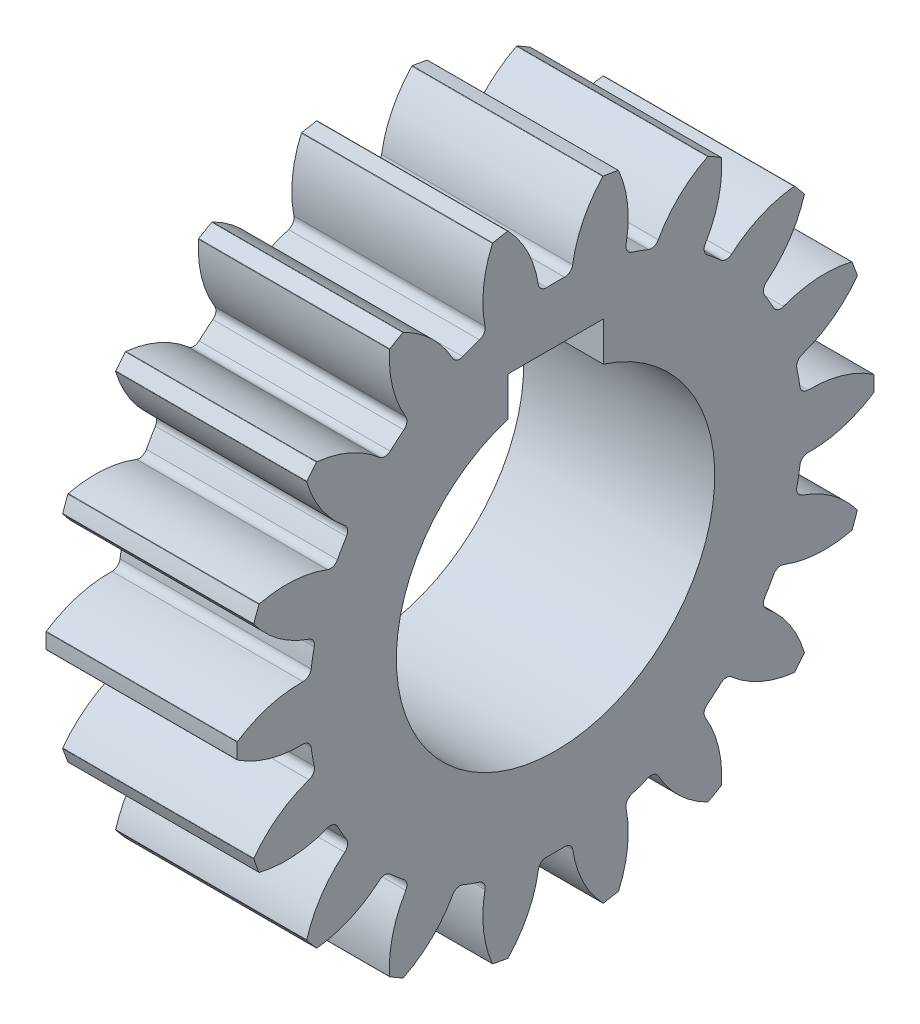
from build123d import *

# Parameters (mm, degrees)
BASPROSKE_W                = 6
BASPROSKE_H                = 10
TOOTHCUT_DEPTH             = 16.362291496
BREAKS_R                   = 0.02
ROOTFILLETS_R              = 0.251
TEETHCUTS_COUNT            = 18
TEETHCUTS_ANGLE            = 340
BREAKS_OF_TEETHCUTS_R      = 0.02
ROOTFILLETS_OF_TEETHCUTS_R = 0.251
BORSKE_R                   = 0.4
BORE_DEPTH                 = 50.0000508
CUT_EXTRUDE_1_DEPTH        = 16.288649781


with BuildPart() as part:
    # BasProSke → Base-Revolve (revolve)
    with BuildSketch(Plane(origin=(0, 0, 0), x_dir=(1, 0, 0), z_dir=(0, 1, 0)), mode=Mode.PRIVATE) as base_revolve_sk:
        with Locations((3, 5)):
            Rectangle(BASPROSKE_W, BASPROSKE_H)
    revolve(base_revolve_sk.sketch.rotate(Axis((-10, 0, 0), (1, 0, 0)), 180), axis=Axis((-10, 0, 0), (1, 0, 0)))

    # TooCutSke → ToothCut (cut, through all)
    with BuildSketch(Plane(origin=(0, 0, 0), x_dir=(0, 0, -1), z_dir=(1, 0, 0))):
        with BuildLine():
            ThreePointArc((0.510641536, 7.732156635), (0, 7.749), (-0.510641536, 7.732156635))
            ThreePointArc((-0.510641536, 7.732156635), (-0.82619259, 8.907320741), (-1.515208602, 9.910236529))
            ThreePointArc((-1.515208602, 9.910236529), (0, 10.0254), (1.515208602, 9.910236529))
            ThreePointArc((1.515208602, 9.910236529), (0.82619259, 8.907320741), (0.510641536, 7.732156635))
        make_face()
    toothcut = extrude(amount=TOOTHCUT_DEPTH, mode=Mode.SUBTRACT)

    # Breaks
    breaks_edges = [part.edges().sort_by_distance(p)[0] for p in [
        (3, 9.887829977, -1.49359243),
        (3, 9.887829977, 1.49359243),
    ]]
    fillet(breaks_edges, radius=BREAKS_R)

    # RootFillets
    rootfillets_edges = [part.edges().sort_by_distance(p)[0] for p in [
        (3, 7.732156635, -0.510641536),
        (3, 7.732156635, 0.510641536),
    ]]
    fillet(rootfillets_edges, radius=ROOTFILLETS_R)

    # TeethCuts: ToothCut ×18 about axis
    teethcuts_axis = Axis((-10, 0, 0), (1, 0, 0))
    for i in range(1, TEETHCUTS_COUNT):
        add(toothcut.rotate(teethcuts_axis, i * TEETHCUTS_ANGLE / (TEETHCUTS_COUNT - 1)), mode=Mode.SUBTRACT)

    # Breaks of TeethCuts
    breaks_of_teethcuts_edges = [part.edges().sort_by_distance(p)[0] for p in [
        (3, 9.802359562, 1.978319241),
        (3, 8.780682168, 4.785354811),
        (3, 8.534579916, 5.211616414),
        (3, 6.6144545, 7.499932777),
        (3, 6.237403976, 7.816315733),
        (3, 3.650426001, 9.309908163),
        (3, 3.187905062, 9.478252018),
        (3, 0.246102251, 9.996971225),
        (3, -0.246102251, 9.996971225),
        (3, -3.187905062, 9.478252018),
        (3, -3.650426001, 9.309908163),
        (3, -6.237403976, 7.816315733),
        (3, -6.6144545, 7.499932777),
        (3, -8.534579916, 5.211616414),
        (3, -8.780682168, 4.785354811),
        (3, -9.802359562, 1.978319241),
        (3, -9.887829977, 1.49359243),
        (3, -9.887829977, -1.49359243),
        (3, -9.802359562, -1.978319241),
        (3, -8.780682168, -4.785354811),
        (3, -8.534579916, -5.211616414),
        (3, -6.6144545, -7.499932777),
        (3, -6.237403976, -7.816315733),
        (3, -3.650426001, -9.309908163),
        (3, -3.187905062, -9.478252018),
        (3, -0.246102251, -9.996971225),
        (3, 0.246102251, -9.996971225),
        (3, 3.187905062, -9.478252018),
        (3, 3.650426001, -9.309908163),
        (3, 6.237403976, -7.816315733),
        (3, 6.6144545, -7.499932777),
        (3, 8.534579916, -5.211616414),
        (3, 8.780682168, -4.785354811),
        (3, 9.802359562, -1.978319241),
    ]]
    fillet(breaks_of_teethcuts_edges, radius=BREAKS_OF_TEETHCUTS_R)

    # RootFillets of TeethCuts
    rootfillets_of_teethcuts_edges = [part.edges().sort_by_distance(p)[0] for p in [
        (3, 7.440500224, 2.164707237),
        (3, 7.091200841, 3.124399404),
        (3, 6.251409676, 4.57896037),
        (3, 5.594941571, 5.361308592),
        (3, 4.30830686, 6.440923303),
        (3, 3.423849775, 6.95156484),
        (3, 1.845558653, 7.526015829),
        (3, 0.839791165, 7.703359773),
        (3, -0.839791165, 7.703359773),
        (3, -1.845558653, 7.526015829),
        (3, -3.423849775, 6.95156484),
        (3, -4.30830686, 6.440923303),
        (3, -5.594941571, 5.361308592),
        (3, -6.251409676, 4.57896037),
        (3, -7.091200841, 3.124399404),
        (3, -7.440500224, 2.164707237),
        (3, -7.732156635, 0.510641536),
        (3, -7.732156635, -0.510641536),
        (3, -7.440500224, -2.164707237),
        (3, -7.091200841, -3.124399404),
        (3, -6.251409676, -4.57896037),
        (3, -5.594941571, -5.361308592),
        (3, -4.30830686, -6.440923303),
        (3, -3.423849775, -6.95156484),
        (3, -1.845558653, -7.526015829),
        (3, -0.839791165, -7.703359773),
        (3, 0.839791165, -7.703359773),
        (3, 1.845558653, -7.526015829),
        (3, 3.423849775, -6.95156484),
        (3, 4.30830686, -6.440923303),
        (3, 5.594941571, -5.361308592),
        (3, 6.251409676, -4.57896037),
        (3, 7.091200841, -3.124399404),
        (3, 7.440500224, -2.164707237),
    ]]
    fillet(rootfillets_of_teethcuts_edges, radius=ROOTFILLETS_OF_TEETHCUTS_R)

    # BorSke → Bore (cut, symmetric)
    with BuildSketch(Plane(origin=(0, 0, 0), x_dir=(0, 0, -1), z_dir=(1, 0, 0))):
        with Locations(Location((0, 0, 0), (0, 0, 180))):
            Circle(BORSKE_R)
    extrude(amount=BORE_DEPTH, both=True, mode=Mode.SUBTRACT)

    # Sketch 2 → Cut-Extrude 1 (cut, through all)
    with BuildSketch(Plane.ZY):
        with BuildLine():
            Line((1.5, 6), (-1.5, 6))
            Line((-1.5, 6), (-1.5, 4.769696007))
            ThreePointArc((-1.5, 4.769696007), (0, -5), (1.5, 4.769696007))
            Line((1.5, 4.769696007), (1.5, 6))
        make_face()
    extrude(amount=-CUT_EXTRUDE_1_DEPTH, mode=Mode.SUBTRACT)


solid = part.part
